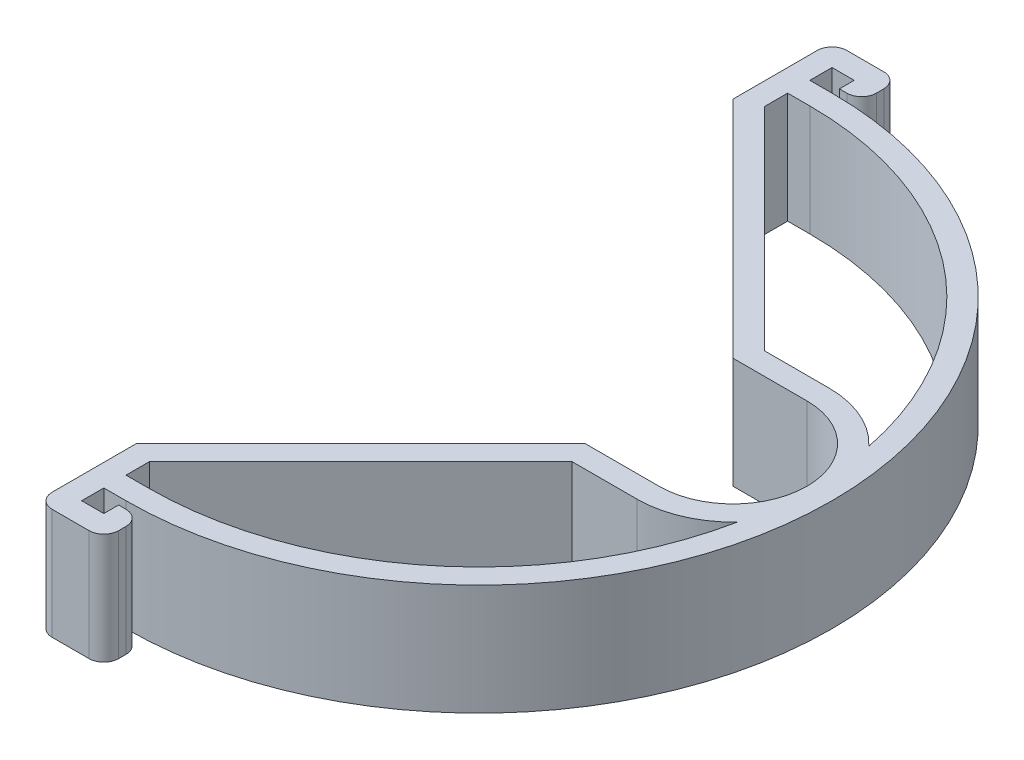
ISO-10303-21;
HEADER;
FILE_DESCRIPTION(('STEP AP214'),'2;1');
FILE_NAME('part.step','',(''),(''),'','','');
FILE_SCHEMA(('AUTOMOTIVE_DESIGN { 1 0 10303 214 1 1 1 1 }'));
ENDSEC;
DATA;
#1=APPLICATION_CONTEXT('core data for automotive mechanical design processes');
#2=APPLICATION_PROTOCOL_DEFINITION('international standard','automotive_design',2000,#1);
#3=PRODUCT_CONTEXT('',#1,'mechanical');
#4=PRODUCT('Part','Part','',(#3));
#5=PRODUCT_RELATED_PRODUCT_CATEGORY('part','',(#4));
#6=PRODUCT_DEFINITION_FORMATION('','',#4);
#7=PRODUCT_DEFINITION_CONTEXT('part definition',#1,'design');
#8=PRODUCT_DEFINITION('design','',#6,#7);
#9=PRODUCT_DEFINITION_SHAPE('','',#8);
#10=(LENGTH_UNIT() NAMED_UNIT(*) SI_UNIT(.MILLI.,.METRE.));
#11=(NAMED_UNIT(*) PLANE_ANGLE_UNIT() SI_UNIT($,.RADIAN.));
#12=(NAMED_UNIT(*) SI_UNIT($,.STERADIAN.) SOLID_ANGLE_UNIT());
#13=UNCERTAINTY_MEASURE_WITH_UNIT(LENGTH_MEASURE(1.E-05),#10,'distance_accuracy_value','');
#14=(GEOMETRIC_REPRESENTATION_CONTEXT(3) GLOBAL_UNCERTAINTY_ASSIGNED_CONTEXT((#13)) GLOBAL_UNIT_ASSIGNED_CONTEXT((#10,
#11,#12)) REPRESENTATION_CONTEXT('',''));
#15=CARTESIAN_POINT('',(0.,0.,0.));
#16=DIRECTION('',(0.,0.,1.));
#17=DIRECTION('',(1.,0.,0.));
#18=AXIS2_PLACEMENT_3D('',#15,#16,#17);
#19=CARTESIAN_POINT('',(0.,15.,13.));
#20=DIRECTION('',(0.,0.,-1.));
#21=DIRECTION('',(-1.,0.,0.));
#22=AXIS2_PLACEMENT_3D('',#19,#20,#21);
#23=PLANE('',#22);
#24=DIRECTION('',(1.,0.,0.));
#25=VECTOR('',#24,1.);
#26=CARTESIAN_POINT('',(0.,0.,13.));
#27=LINE('',#26,#25);
#28=CARTESIAN_POINT('',(25.6032906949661,0.,13.));
#29=VERTEX_POINT('',#28);
#30=CARTESIAN_POINT('',(34.3606500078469,0.,13.));
#31=VERTEX_POINT('',#30);
#32=EDGE_CURVE('E474',#29,#31,#27,.T.);
#33=ORIENTED_EDGE('',*,*,#32,.T.);
#34=DIRECTION('',(0.,-1.,0.));
#35=VECTOR('',#34,1.);
#36=CARTESIAN_POINT('',(34.3606500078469,15.,13.));
#37=LINE('',#36,#35);
#38=CARTESIAN_POINT('',(34.3606500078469,15.,13.));
#39=VERTEX_POINT('',#38);
#40=EDGE_CURVE('E11',#39,#31,#37,.T.);
#41=ORIENTED_EDGE('',*,*,#40,.F.);
#42=DIRECTION('',(1.,0.,0.));
#43=VECTOR('',#42,1.);
#44=CARTESIAN_POINT('',(0.,15.,13.));
#45=LINE('',#44,#43);
#46=CARTESIAN_POINT('',(25.6032906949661,15.,13.));
#47=VERTEX_POINT('',#46);
#48=EDGE_CURVE('E1049',#47,#39,#45,.T.);
#49=ORIENTED_EDGE('',*,*,#48,.F.);
#50=DIRECTION('',(0.,-1.,0.));
#51=VECTOR('',#50,1.);
#52=CARTESIAN_POINT('',(25.6032906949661,15.,13.));
#53=LINE('',#52,#51);
#54=EDGE_CURVE('E61',#47,#29,#53,.T.);
#55=ORIENTED_EDGE('',*,*,#54,.T.);
#56=EDGE_LOOP('',(#33,#41,#49,#55));
#57=FACE_BOUND('',#56,.T.);
#58=ADVANCED_FACE('F41',(#57),#23,.F.);
#59=CARTESIAN_POINT('',(34.3606500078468,15.,0.));
#60=DIRECTION('',(0.,-1.,0.));
#61=DIRECTION('',(0.,0.,-1.));
#62=AXIS2_PLACEMENT_3D('',#59,#60,#61);
#63=CYLINDRICAL_SURFACE('',#62,13.);
#64=CARTESIAN_POINT('',(34.3606500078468,0.,0.));
#65=DIRECTION('',(0.,1.,0.));
#66=DIRECTION('',(0.,0.,1.));
#67=AXIS2_PLACEMENT_3D('',#64,#65,#66);
#68=CIRCLE('',#67,13.);
#69=CARTESIAN_POINT('',(43.8614631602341,0.,8.87324909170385));
#70=VERTEX_POINT('',#69);
#71=EDGE_CURVE('E477',#31,#70,#68,.T.);
#72=ORIENTED_EDGE('',*,*,#71,.T.);
#73=DIRECTION('',(0.,-1.,0.));
#74=VECTOR('',#73,1.);
#75=CARTESIAN_POINT('',(43.8614631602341,15.,8.87324909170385));
#76=LINE('',#75,#74);
#77=CARTESIAN_POINT('',(43.8614631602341,15.,8.87324909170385));
#78=VERTEX_POINT('',#77);
#79=EDGE_CURVE('E52',#78,#70,#76,.T.);
#80=ORIENTED_EDGE('',*,*,#79,.F.);
#81=CARTESIAN_POINT('',(34.3606500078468,15.,0.));
#82=DIRECTION('',(0.,1.,0.));
#83=DIRECTION('',(0.,0.,1.));
#84=AXIS2_PLACEMENT_3D('',#81,#82,#83);
#85=CIRCLE('',#84,13.);
#86=EDGE_CURVE('E1050',#39,#78,#85,.T.);
#87=ORIENTED_EDGE('',*,*,#86,.F.);
#88=ORIENTED_EDGE('',*,*,#40,.T.);
#89=EDGE_LOOP('',(#72,#80,#87,#88));
#90=FACE_BOUND('',#89,.T.);
#91=ADVANCED_FACE('F649',(#90),#63,.T.);
#92=CARTESIAN_POINT('',(0.,15.,0.));
#93=DIRECTION('',(0.,-1.,0.));
#94=DIRECTION('',(0.,0.,-1.));
#95=AXIS2_PLACEMENT_3D('',#92,#93,#94);
#96=CYLINDRICAL_SURFACE('',#95,44.75);
#97=CARTESIAN_POINT('',(0.,0.,0.));
#98=DIRECTION('',(0.,1.,0.));
#99=DIRECTION('',(0.,0.,1.));
#100=AXIS2_PLACEMENT_3D('',#97,#98,#99);
#101=CIRCLE('',#100,44.75);
#102=CARTESIAN_POINT('',(0.,0.,44.75));
#103=VERTEX_POINT('',#102);
#104=EDGE_CURVE('E481',#103,#70,#101,.T.);
#105=ORIENTED_EDGE('',*,*,#104,.F.);
#106=DIRECTION('',(0.,-1.,0.));
#107=VECTOR('',#106,1.);
#108=CARTESIAN_POINT('',(0.,15.,44.75));
#109=LINE('',#108,#107);
#110=CARTESIAN_POINT('',(0.,15.,44.75));
#111=VERTEX_POINT('',#110);
#112=EDGE_CURVE('E328',#111,#103,#109,.T.);
#113=ORIENTED_EDGE('',*,*,#112,.F.);
#114=CARTESIAN_POINT('',(0.,15.,0.));
#115=DIRECTION('',(0.,1.,0.));
#116=DIRECTION('',(0.,0.,1.));
#117=AXIS2_PLACEMENT_3D('',#114,#115,#116);
#118=CIRCLE('',#117,44.75);
#119=EDGE_CURVE('E316',#111,#78,#118,.T.);
#120=ORIENTED_EDGE('',*,*,#119,.T.);
#121=ORIENTED_EDGE('',*,*,#79,.T.);
#122=EDGE_LOOP('',(#105,#113,#120,#121));
#123=FACE_BOUND('',#122,.T.);
#124=ADVANCED_FACE('F654',(#123),#96,.F.);
#125=CARTESIAN_POINT('',(0.,15.,44.75));
#126=DIRECTION('',(0.,0.,1.));
#127=DIRECTION('',(1.,0.,0.));
#128=AXIS2_PLACEMENT_3D('',#125,#126,#127);
#129=PLANE('',#128);
#130=DIRECTION('',(-1.,0.,0.));
#131=VECTOR('',#130,1.);
#132=CARTESIAN_POINT('',(0.,0.,44.75));
#133=LINE('',#132,#131);
#134=CARTESIAN_POINT('',(-2.99999999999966,0.,44.75));
#135=VERTEX_POINT('',#134);
#136=EDGE_CURVE('E324',#103,#135,#133,.T.);
#137=ORIENTED_EDGE('',*,*,#136,.T.);
#138=DIRECTION('',(0.,-1.,0.));
#139=VECTOR('',#138,1.);
#140=CARTESIAN_POINT('',(-2.99999999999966,15.,44.75));
#141=LINE('',#140,#139);
#142=CARTESIAN_POINT('',(-2.99999999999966,15.,44.75));
#143=VERTEX_POINT('',#142);
#144=EDGE_CURVE('E321',#143,#135,#141,.T.);
#145=ORIENTED_EDGE('',*,*,#144,.F.);
#146=DIRECTION('',(-1.,0.,0.));
#147=VECTOR('',#146,1.);
#148=CARTESIAN_POINT('',(0.,15.,44.75));
#149=LINE('',#148,#147);
#150=EDGE_CURVE('E308',#111,#143,#149,.T.);
#151=ORIENTED_EDGE('',*,*,#150,.F.);
#152=ORIENTED_EDGE('',*,*,#112,.T.);
#153=EDGE_LOOP('',(#137,#145,#151,#152));
#154=FACE_BOUND('',#153,.T.);
#155=ADVANCED_FACE('F322',(#154),#129,.F.);
#156=CARTESIAN_POINT('',(-2.99999999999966,15.,0.));
#157=DIRECTION('',(1.,0.,0.));
#158=DIRECTION('',(0.,0.,-1.));
#159=AXIS2_PLACEMENT_3D('',#156,#157,#158);
#160=PLANE('',#159);
#161=DIRECTION('',(0.,0.,1.));
#162=VECTOR('',#161,1.);
#163=CARTESIAN_POINT('',(-2.99999999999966,0.,0.));
#164=LINE('',#163,#162);
#165=CARTESIAN_POINT('',(-2.99999999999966,0.,41.6032906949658));
#166=VERTEX_POINT('',#165);
#167=EDGE_CURVE('E487',#166,#135,#164,.T.);
#168=ORIENTED_EDGE('',*,*,#167,.F.);
#169=DIRECTION('',(0.,-1.,0.));
#170=VECTOR('',#169,1.);
#171=CARTESIAN_POINT('',(-2.99999999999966,15.,41.6032906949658));
#172=LINE('',#171,#170);
#173=CARTESIAN_POINT('',(-2.99999999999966,15.,41.6032906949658));
#174=VERTEX_POINT('',#173);
#175=EDGE_CURVE('E183',#174,#166,#172,.T.);
#176=ORIENTED_EDGE('',*,*,#175,.F.);
#177=DIRECTION('',(0.,0.,1.));
#178=VECTOR('',#177,1.);
#179=CARTESIAN_POINT('',(-2.99999999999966,15.,0.));
#180=LINE('',#179,#178);
#181=EDGE_CURVE('E314',#174,#143,#180,.T.);
#182=ORIENTED_EDGE('',*,*,#181,.T.);
#183=ORIENTED_EDGE('',*,*,#144,.T.);
#184=EDGE_LOOP('',(#168,#176,#182,#183));
#185=FACE_BOUND('',#184,.T.);
#186=ADVANCED_FACE('F330',(#185),#160,.T.);
#187=CARTESIAN_POINT('',(0.99999999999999,15.,50.75));
#188=DIRECTION('',(0.,-1.,0.));
#189=DIRECTION('',(0.,0.,-1.));
#190=AXIS2_PLACEMENT_3D('',#187,#188,#189);
#191=CYLINDRICAL_SURFACE('',#190,2.);
#192=CARTESIAN_POINT('',(0.99999999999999,0.,50.75));
#193=DIRECTION('',(0.,1.,0.));
#194=DIRECTION('',(0.,0.,1.));
#195=AXIS2_PLACEMENT_3D('',#192,#193,#194);
#196=CIRCLE('',#195,2.);
#197=CARTESIAN_POINT('',(0.999999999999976,0.,48.75));
#198=VERTEX_POINT('',#197);
#199=CARTESIAN_POINT('',(2.99999999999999,0.,50.75));
#200=VERTEX_POINT('',#199);
#201=EDGE_CURVE('E362',#198,#200,#196,.F.);
#202=ORIENTED_EDGE('',*,*,#201,.F.);
#203=DIRECTION('',(0.,-1.,0.));
#204=VECTOR('',#203,1.);
#205=CARTESIAN_POINT('',(0.999999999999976,15.,48.75));
#206=LINE('',#205,#204);
#207=CARTESIAN_POINT('',(0.999999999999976,15.,48.75));
#208=VERTEX_POINT('',#207);
#209=EDGE_CURVE('E497',#208,#198,#206,.T.);
#210=ORIENTED_EDGE('',*,*,#209,.F.);
#211=CARTESIAN_POINT('',(0.99999999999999,15.,50.75));
#212=DIRECTION('',(0.,1.,0.));
#213=DIRECTION('',(0.,0.,1.));
#214=AXIS2_PLACEMENT_3D('',#211,#212,#213);
#215=CIRCLE('',#214,2.);
#216=CARTESIAN_POINT('',(2.99999999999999,15.,50.75));
#217=VERTEX_POINT('',#216);
#218=EDGE_CURVE('E1161',#208,#217,#215,.F.);
#219=ORIENTED_EDGE('',*,*,#218,.T.);
#220=DIRECTION('',(0.,-1.,0.));
#221=VECTOR('',#220,1.);
#222=CARTESIAN_POINT('',(2.99999999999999,15.,50.75));
#223=LINE('',#222,#221);
#224=EDGE_CURVE('E504',#217,#200,#223,.T.);
#225=ORIENTED_EDGE('',*,*,#224,.T.);
#226=EDGE_LOOP('',(#202,#210,#219,#225));
#227=FACE_BOUND('',#226,.T.);
#228=ADVANCED_FACE('F766',(#227),#191,.T.);
#229=CARTESIAN_POINT('',(0.,15.,48.75));
#230=DIRECTION('',(0.,0.,-1.));
#231=DIRECTION('',(-1.,0.,0.));
#232=AXIS2_PLACEMENT_3D('',#229,#230,#231);
#233=PLANE('',#232);
#234=DIRECTION('',(1.,0.,0.));
#235=VECTOR('',#234,1.);
#236=CARTESIAN_POINT('',(0.,0.,48.75));
#237=LINE('',#236,#235);
#238=CARTESIAN_POINT('',(0.,0.,48.75));
#239=VERTEX_POINT('',#238);
#240=EDGE_CURVE('E366',#239,#198,#237,.T.);
#241=ORIENTED_EDGE('',*,*,#240,.F.);
#242=DIRECTION('',(0.,-1.,0.));
#243=VECTOR('',#242,1.);
#244=CARTESIAN_POINT('',(0.,15.,48.75));
#245=LINE('',#244,#243);
#246=CARTESIAN_POINT('',(0.,15.,48.75));
#247=VERTEX_POINT('',#246);
#248=EDGE_CURVE('E591',#247,#239,#245,.T.);
#249=ORIENTED_EDGE('',*,*,#248,.F.);
#250=DIRECTION('',(1.,0.,0.));
#251=VECTOR('',#250,1.);
#252=CARTESIAN_POINT('',(0.,15.,48.75));
#253=LINE('',#252,#251);
#254=EDGE_CURVE('E1157',#247,#208,#253,.T.);
#255=ORIENTED_EDGE('',*,*,#254,.T.);
#256=ORIENTED_EDGE('',*,*,#209,.T.);
#257=EDGE_LOOP('',(#241,#249,#255,#256));
#258=FACE_BOUND('',#257,.T.);
#259=ADVANCED_FACE('F762',(#258),#233,.T.);
#260=CARTESIAN_POINT('',(0.,15.,0.));
#261=DIRECTION('',(-1.,0.,0.));
#262=DIRECTION('',(0.,0.,1.));
#263=AXIS2_PLACEMENT_3D('',#260,#261,#262);
#264=PLANE('',#263);
#265=DIRECTION('',(0.,0.,-1.));
#266=VECTOR('',#265,1.);
#267=CARTESIAN_POINT('',(0.,0.,0.));
#268=LINE('',#267,#266);
#269=CARTESIAN_POINT('',(-2.70699938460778E-13,0.,50.75));
#270=VERTEX_POINT('',#269);
#271=EDGE_CURVE('E370',#270,#239,#268,.T.);
#272=ORIENTED_EDGE('',*,*,#271,.F.);
#273=DIRECTION('',(0.,-1.,0.));
#274=VECTOR('',#273,1.);
#275=CARTESIAN_POINT('',(-2.70699938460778E-13,15.,50.75));
#276=LINE('',#275,#274);
#277=CARTESIAN_POINT('',(-2.70699938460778E-13,15.,50.75));
#278=VERTEX_POINT('',#277);
#279=EDGE_CURVE('E588',#278,#270,#276,.T.);
#280=ORIENTED_EDGE('',*,*,#279,.F.);
#281=DIRECTION('',(0.,0.,-1.));
#282=VECTOR('',#281,1.);
#283=CARTESIAN_POINT('',(0.,15.,0.));
#284=LINE('',#283,#282);
#285=EDGE_CURVE('E1153',#278,#247,#284,.T.);
#286=ORIENTED_EDGE('',*,*,#285,.T.);
#287=ORIENTED_EDGE('',*,*,#248,.T.);
#288=EDGE_LOOP('',(#272,#280,#286,#287));
#289=FACE_BOUND('',#288,.T.);
#290=ADVANCED_FACE('F758',(#289),#264,.T.);
#291=CARTESIAN_POINT('',(0.,15.,50.75));
#292=DIRECTION('',(0.,0.,-1.));
#293=DIRECTION('',(-1.,0.,0.));
#294=AXIS2_PLACEMENT_3D('',#291,#292,#293);
#295=PLANE('',#294);
#296=DIRECTION('',(1.,0.,0.));
#297=VECTOR('',#296,1.);
#298=CARTESIAN_POINT('',(0.,0.,50.75));
#299=LINE('',#298,#297);
#300=CARTESIAN_POINT('',(-3.00000000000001,0.,50.75));
#301=VERTEX_POINT('',#300);
#302=EDGE_CURVE('E374',#301,#270,#299,.T.);
#303=ORIENTED_EDGE('',*,*,#302,.F.);
#304=DIRECTION('',(0.,-1.,0.));
#305=VECTOR('',#304,1.);
#306=CARTESIAN_POINT('',(-3.00000000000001,15.,50.75));
#307=LINE('',#306,#305);
#308=CARTESIAN_POINT('',(-3.00000000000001,15.,50.75));
#309=VERTEX_POINT('',#308);
#310=EDGE_CURVE('E585',#309,#301,#307,.T.);
#311=ORIENTED_EDGE('',*,*,#310,.F.);
#312=DIRECTION('',(1.,0.,0.));
#313=VECTOR('',#312,1.);
#314=CARTESIAN_POINT('',(0.,15.,50.75));
#315=LINE('',#314,#313);
#316=EDGE_CURVE('E1149',#309,#278,#315,.T.);
#317=ORIENTED_EDGE('',*,*,#316,.T.);
#318=ORIENTED_EDGE('',*,*,#279,.T.);
#319=EDGE_LOOP('',(#303,#311,#317,#318));
#320=FACE_BOUND('',#319,.T.);
#321=ADVANCED_FACE('F754',(#320),#295,.T.);
#322=CARTESIAN_POINT('',(-3.00000000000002,15.,0.));
#323=DIRECTION('',(-1.,0.,0.));
#324=DIRECTION('',(0.,0.,1.));
#325=AXIS2_PLACEMENT_3D('',#322,#323,#324);
#326=PLANE('',#325);
#327=DIRECTION('',(0.,0.,-1.));
#328=VECTOR('',#327,1.);
#329=CARTESIAN_POINT('',(-3.00000000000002,0.,0.));
#330=LINE('',#329,#328);
#331=CARTESIAN_POINT('',(-3.00000000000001,0.,47.75));
#332=VERTEX_POINT('',#331);
#333=EDGE_CURVE('E378',#301,#332,#330,.T.);
#334=ORIENTED_EDGE('',*,*,#333,.T.);
#335=DIRECTION('',(0.,-1.,0.));
#336=VECTOR('',#335,1.);
#337=CARTESIAN_POINT('',(-3.00000000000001,15.,47.75));
#338=LINE('',#337,#336);
#339=CARTESIAN_POINT('',(-3.00000000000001,15.,47.75));
#340=VERTEX_POINT('',#339);
#341=EDGE_CURVE('E582',#340,#332,#338,.T.);
#342=ORIENTED_EDGE('',*,*,#341,.F.);
#343=DIRECTION('',(0.,0.,-1.));
#344=VECTOR('',#343,1.);
#345=CARTESIAN_POINT('',(-3.00000000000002,15.,0.));
#346=LINE('',#345,#344);
#347=EDGE_CURVE('E1146',#309,#340,#346,.T.);
#348=ORIENTED_EDGE('',*,*,#347,.F.);
#349=ORIENTED_EDGE('',*,*,#310,.T.);
#350=EDGE_LOOP('',(#334,#342,#348,#349));
#351=FACE_BOUND('',#350,.T.);
#352=ADVANCED_FACE('F750',(#351),#326,.F.);
#353=CARTESIAN_POINT('',(0.,15.,47.75));
#354=DIRECTION('',(0.,0.,1.));
#355=DIRECTION('',(1.,0.,0.));
#356=AXIS2_PLACEMENT_3D('',#353,#354,#355);
#357=PLANE('',#356);
#358=DIRECTION('',(-1.,0.,0.));
#359=VECTOR('',#358,1.);
#360=CARTESIAN_POINT('',(0.,0.,47.75));
#361=LINE('',#360,#359);
#362=CARTESIAN_POINT('',(0.,0.,47.75));
#363=VERTEX_POINT('',#362);
#364=EDGE_CURVE('E382',#363,#332,#361,.T.);
#365=ORIENTED_EDGE('',*,*,#364,.F.);
#366=DIRECTION('',(0.,-1.,0.));
#367=VECTOR('',#366,1.);
#368=CARTESIAN_POINT('',(0.,15.,47.75));
#369=LINE('',#368,#367);
#370=CARTESIAN_POINT('',(0.,15.,47.75));
#371=VERTEX_POINT('',#370);
#372=EDGE_CURVE('E579',#371,#363,#369,.T.);
#373=ORIENTED_EDGE('',*,*,#372,.F.);
#374=DIRECTION('',(-1.,0.,0.));
#375=VECTOR('',#374,1.);
#376=CARTESIAN_POINT('',(0.,15.,47.75));
#377=LINE('',#376,#375);
#378=EDGE_CURVE('E1142',#371,#340,#377,.T.);
#379=ORIENTED_EDGE('',*,*,#378,.T.);
#380=ORIENTED_EDGE('',*,*,#341,.T.);
#381=EDGE_LOOP('',(#365,#373,#379,#380));
#382=FACE_BOUND('',#381,.T.);
#383=ADVANCED_FACE('F746',(#382),#357,.T.);
#384=CARTESIAN_POINT('',(0.,15.,0.));
#385=DIRECTION('',(0.,-1.,0.));
#386=DIRECTION('',(0.,0.,-1.));
#387=AXIS2_PLACEMENT_3D('',#384,#385,#386);
#388=CYLINDRICAL_SURFACE('',#387,47.75);
#389=CARTESIAN_POINT('',(0.,0.,0.));
#390=DIRECTION('',(0.,1.,0.));
#391=DIRECTION('',(0.,0.,1.));
#392=AXIS2_PLACEMENT_3D('',#389,#390,#391);
#393=CIRCLE('',#392,47.75);
#394=CARTESIAN_POINT('',(0.,0.,-47.75));
#395=VERTEX_POINT('',#394);
#396=EDGE_CURVE('E386',#363,#395,#393,.T.);
#397=ORIENTED_EDGE('',*,*,#396,.T.);
#398=DIRECTION('',(0.,-1.,0.));
#399=VECTOR('',#398,1.);
#400=CARTESIAN_POINT('',(0.,15.,-47.75));
#401=LINE('',#400,#399);
#402=CARTESIAN_POINT('',(0.,15.,-47.75));
#403=VERTEX_POINT('',#402);
#404=EDGE_CURVE('E575',#403,#395,#401,.T.);
#405=ORIENTED_EDGE('',*,*,#404,.F.);
#406=CARTESIAN_POINT('',(0.,15.,0.));
#407=DIRECTION('',(0.,1.,0.));
#408=DIRECTION('',(0.,0.,1.));
#409=AXIS2_PLACEMENT_3D('',#406,#407,#408);
#410=CIRCLE('',#409,47.75);
#411=EDGE_CURVE('E1138',#371,#403,#410,.T.);
#412=ORIENTED_EDGE('',*,*,#411,.F.);
#413=ORIENTED_EDGE('',*,*,#372,.T.);
#414=EDGE_LOOP('',(#397,#405,#412,#413));
#415=FACE_BOUND('',#414,.T.);
#416=ADVANCED_FACE('F742',(#415),#388,.T.);
#417=CARTESIAN_POINT('',(0.,15.,-47.75));
#418=DIRECTION('',(0.,0.,1.));
#419=DIRECTION('',(1.,0.,0.));
#420=AXIS2_PLACEMENT_3D('',#417,#418,#419);
#421=PLANE('',#420);
#422=DIRECTION('',(-1.,0.,0.));
#423=VECTOR('',#422,1.);
#424=CARTESIAN_POINT('',(0.,0.,-47.75));
#425=LINE('',#424,#423);
#426=CARTESIAN_POINT('',(-3.00000000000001,0.,-47.75));
#427=VERTEX_POINT('',#426);
#428=EDGE_CURVE('E390',#395,#427,#425,.T.);
#429=ORIENTED_EDGE('',*,*,#428,.T.);
#430=DIRECTION('',(0.,-1.,0.));
#431=VECTOR('',#430,1.);
#432=CARTESIAN_POINT('',(-3.00000000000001,15.,-47.75));
#433=LINE('',#432,#431);
#434=CARTESIAN_POINT('',(-3.00000000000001,15.,-47.75));
#435=VERTEX_POINT('',#434);
#436=EDGE_CURVE('E572',#435,#427,#433,.T.);
#437=ORIENTED_EDGE('',*,*,#436,.F.);
#438=DIRECTION('',(-1.,0.,0.));
#439=VECTOR('',#438,1.);
#440=CARTESIAN_POINT('',(0.,15.,-47.75));
#441=LINE('',#440,#439);
#442=EDGE_CURVE('E1135',#403,#435,#441,.T.);
#443=ORIENTED_EDGE('',*,*,#442,.F.);
#444=ORIENTED_EDGE('',*,*,#404,.T.);
#445=EDGE_LOOP('',(#429,#437,#443,#444));
#446=FACE_BOUND('',#445,.T.);
#447=ADVANCED_FACE('F738',(#446),#421,.F.);
#448=CARTESIAN_POINT('',(-3.00000000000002,15.,0.));
#449=DIRECTION('',(1.,0.,0.));
#450=DIRECTION('',(0.,0.,-1.));
#451=AXIS2_PLACEMENT_3D('',#448,#449,#450);
#452=PLANE('',#451);
#453=DIRECTION('',(0.,0.,1.));
#454=VECTOR('',#453,1.);
#455=CARTESIAN_POINT('',(-3.00000000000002,0.,0.));
#456=LINE('',#455,#454);
#457=CARTESIAN_POINT('',(-3.00000000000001,0.,-50.75));
#458=VERTEX_POINT('',#457);
#459=EDGE_CURVE('E394',#458,#427,#456,.T.);
#460=ORIENTED_EDGE('',*,*,#459,.F.);
#461=DIRECTION('',(0.,-1.,0.));
#462=VECTOR('',#461,1.);
#463=CARTESIAN_POINT('',(-3.00000000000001,15.,-50.75));
#464=LINE('',#463,#462);
#465=CARTESIAN_POINT('',(-3.00000000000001,15.,-50.75));
#466=VERTEX_POINT('',#465);
#467=EDGE_CURVE('E569',#466,#458,#464,.T.);
#468=ORIENTED_EDGE('',*,*,#467,.F.);
#469=DIRECTION('',(0.,0.,1.));
#470=VECTOR('',#469,1.);
#471=CARTESIAN_POINT('',(-3.00000000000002,15.,0.));
#472=LINE('',#471,#470);
#473=EDGE_CURVE('E1131',#466,#435,#472,.T.);
#474=ORIENTED_EDGE('',*,*,#473,.T.);
#475=ORIENTED_EDGE('',*,*,#436,.T.);
#476=EDGE_LOOP('',(#460,#468,#474,#475));
#477=FACE_BOUND('',#476,.T.);
#478=ADVANCED_FACE('F734',(#477),#452,.T.);
#479=CARTESIAN_POINT('',(0.,15.,-50.75));
#480=DIRECTION('',(0.,0.,-1.));
#481=DIRECTION('',(-1.,0.,0.));
#482=AXIS2_PLACEMENT_3D('',#479,#480,#481);
#483=PLANE('',#482);
#484=DIRECTION('',(1.,0.,0.));
#485=VECTOR('',#484,1.);
#486=CARTESIAN_POINT('',(0.,0.,-50.75));
#487=LINE('',#486,#485);
#488=CARTESIAN_POINT('',(0.,0.,-50.75));
#489=VERTEX_POINT('',#488);
#490=EDGE_CURVE('E398',#458,#489,#487,.T.);
#491=ORIENTED_EDGE('',*,*,#490,.T.);
#492=DIRECTION('',(0.,-1.,0.));
#493=VECTOR('',#492,1.);
#494=CARTESIAN_POINT('',(0.,15.,-50.75));
#495=LINE('',#494,#493);
#496=CARTESIAN_POINT('',(0.,15.,-50.75));
#497=VERTEX_POINT('',#496);
#498=EDGE_CURVE('E565',#497,#489,#495,.T.);
#499=ORIENTED_EDGE('',*,*,#498,.F.);
#500=DIRECTION('',(1.,0.,0.));
#501=VECTOR('',#500,1.);
#502=CARTESIAN_POINT('',(0.,15.,-50.75));
#503=LINE('',#502,#501);
#504=EDGE_CURVE('E1127',#466,#497,#503,.T.);
#505=ORIENTED_EDGE('',*,*,#504,.F.);
#506=ORIENTED_EDGE('',*,*,#467,.T.);
#507=EDGE_LOOP('',(#491,#499,#505,#506));
#508=FACE_BOUND('',#507,.T.);
#509=ADVANCED_FACE('F730',(#508),#483,.F.);
#510=CARTESIAN_POINT('',(0.,15.,0.));
#511=DIRECTION('',(1.,0.,0.));
#512=DIRECTION('',(0.,0.,-1.));
#513=AXIS2_PLACEMENT_3D('',#510,#511,#512);
#514=PLANE('',#513);
#515=DIRECTION('',(0.,0.,1.));
#516=VECTOR('',#515,1.);
#517=CARTESIAN_POINT('',(0.,0.,0.));
#518=LINE('',#517,#516);
#519=CARTESIAN_POINT('',(-2.60031960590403E-13,0.,-48.75));
#520=VERTEX_POINT('',#519);
#521=EDGE_CURVE('E402',#489,#520,#518,.T.);
#522=ORIENTED_EDGE('',*,*,#521,.T.);
#523=DIRECTION('',(0.,-1.,0.));
#524=VECTOR('',#523,1.);
#525=CARTESIAN_POINT('',(-2.60031960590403E-13,15.,-48.75));
#526=LINE('',#525,#524);
#527=CARTESIAN_POINT('',(-2.60031960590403E-13,15.,-48.75));
#528=VERTEX_POINT('',#527);
#529=EDGE_CURVE('E561',#528,#520,#526,.T.);
#530=ORIENTED_EDGE('',*,*,#529,.F.);
#531=DIRECTION('',(0.,0.,1.));
#532=VECTOR('',#531,1.);
#533=CARTESIAN_POINT('',(0.,15.,0.));
#534=LINE('',#533,#532);
#535=EDGE_CURVE('E1123',#497,#528,#534,.T.);
#536=ORIENTED_EDGE('',*,*,#535,.F.);
#537=ORIENTED_EDGE('',*,*,#498,.T.);
#538=EDGE_LOOP('',(#522,#530,#536,#537));
#539=FACE_BOUND('',#538,.T.);
#540=ADVANCED_FACE('F726',(#539),#514,.F.);
#541=CARTESIAN_POINT('',(0.,15.,-48.75));
#542=DIRECTION('',(0.,0.,-1.));
#543=DIRECTION('',(-1.,0.,0.));
#544=AXIS2_PLACEMENT_3D('',#541,#542,#543);
#545=PLANE('',#544);
#546=DIRECTION('',(1.,0.,0.));
#547=VECTOR('',#546,1.);
#548=CARTESIAN_POINT('',(0.,0.,-48.75));
#549=LINE('',#548,#547);
#550=CARTESIAN_POINT('',(0.999999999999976,0.,-48.75));
#551=VERTEX_POINT('',#550);
#552=EDGE_CURVE('E406',#520,#551,#549,.T.);
#553=ORIENTED_EDGE('',*,*,#552,.T.);
#554=DIRECTION('',(0.,-1.,0.));
#555=VECTOR('',#554,1.);
#556=CARTESIAN_POINT('',(0.999999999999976,15.,-48.75));
#557=LINE('',#556,#555);
#558=CARTESIAN_POINT('',(0.999999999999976,15.,-48.75));
#559=VERTEX_POINT('',#558);
#560=EDGE_CURVE('E557',#559,#551,#557,.T.);
#561=ORIENTED_EDGE('',*,*,#560,.F.);
#562=DIRECTION('',(1.,0.,0.));
#563=VECTOR('',#562,1.);
#564=CARTESIAN_POINT('',(0.,15.,-48.75));
#565=LINE('',#564,#563);
#566=EDGE_CURVE('E1119',#528,#559,#565,.T.);
#567=ORIENTED_EDGE('',*,*,#566,.F.);
#568=ORIENTED_EDGE('',*,*,#529,.T.);
#569=EDGE_LOOP('',(#553,#561,#567,#568));
#570=FACE_BOUND('',#569,.T.);
#571=ADVANCED_FACE('F722',(#570),#545,.F.);
#572=CARTESIAN_POINT('',(0.99999999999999,15.,-50.75));
#573=DIRECTION('',(0.,-1.,0.));
#574=DIRECTION('',(0.,0.,-1.));
#575=AXIS2_PLACEMENT_3D('',#572,#573,#574);
#576=CYLINDRICAL_SURFACE('',#575,2.);
#577=CARTESIAN_POINT('',(0.99999999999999,0.,-50.75));
#578=DIRECTION('',(0.,1.,0.));
#579=DIRECTION('',(0.,0.,1.));
#580=AXIS2_PLACEMENT_3D('',#577,#578,#579);
#581=CIRCLE('',#580,2.);
#582=CARTESIAN_POINT('',(2.99999999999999,0.,-50.75));
#583=VERTEX_POINT('',#582);
#584=EDGE_CURVE('E410',#551,#583,#581,.T.);
#585=ORIENTED_EDGE('',*,*,#584,.T.);
#586=DIRECTION('',(0.,-1.,0.));
#587=VECTOR('',#586,1.);
#588=CARTESIAN_POINT('',(2.99999999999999,15.,-50.75));
#589=LINE('',#588,#587);
#590=CARTESIAN_POINT('',(2.99999999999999,15.,-50.75));
#591=VERTEX_POINT('',#590);
#592=EDGE_CURVE('E554',#591,#583,#589,.T.);
#593=ORIENTED_EDGE('',*,*,#592,.F.);
#594=CARTESIAN_POINT('',(0.99999999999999,15.,-50.75));
#595=DIRECTION('',(0.,1.,0.));
#596=DIRECTION('',(0.,0.,1.));
#597=AXIS2_PLACEMENT_3D('',#594,#595,#596);
#598=CIRCLE('',#597,2.);
#599=EDGE_CURVE('E1116',#559,#591,#598,.T.);
#600=ORIENTED_EDGE('',*,*,#599,.F.);
#601=ORIENTED_EDGE('',*,*,#560,.T.);
#602=EDGE_LOOP('',(#585,#593,#600,#601));
#603=FACE_BOUND('',#602,.T.);
#604=ADVANCED_FACE('F718',(#603),#576,.T.);
#605=CARTESIAN_POINT('',(2.99999999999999,15.,0.));
#606=DIRECTION('',(1.,0.,0.));
#607=DIRECTION('',(0.,0.,-1.));
#608=AXIS2_PLACEMENT_3D('',#605,#606,#607);
#609=PLANE('',#608);
#610=DIRECTION('',(0.,0.,1.));
#611=VECTOR('',#610,1.);
#612=CARTESIAN_POINT('',(2.99999999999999,0.,0.));
#613=LINE('',#612,#611);
#614=CARTESIAN_POINT('',(2.99999999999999,0.,-51.75));
#615=VERTEX_POINT('',#614);
#616=EDGE_CURVE('E414',#615,#583,#613,.T.);
#617=ORIENTED_EDGE('',*,*,#616,.F.);
#618=DIRECTION('',(0.,-1.,0.));
#619=VECTOR('',#618,1.);
#620=CARTESIAN_POINT('',(2.99999999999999,15.,-51.75));
#621=LINE('',#620,#619);
#622=CARTESIAN_POINT('',(2.99999999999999,15.,-51.75));
#623=VERTEX_POINT('',#622);
#624=EDGE_CURVE('E551',#623,#615,#621,.T.);
#625=ORIENTED_EDGE('',*,*,#624,.F.);
#626=DIRECTION('',(0.,0.,1.));
#627=VECTOR('',#626,1.);
#628=CARTESIAN_POINT('',(2.99999999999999,15.,0.));
#629=LINE('',#628,#627);
#630=EDGE_CURVE('E1112',#623,#591,#629,.T.);
#631=ORIENTED_EDGE('',*,*,#630,.T.);
#632=ORIENTED_EDGE('',*,*,#592,.T.);
#633=EDGE_LOOP('',(#617,#625,#631,#632));
#634=FACE_BOUND('',#633,.T.);
#635=ADVANCED_FACE('F714',(#634),#609,.T.);
#636=CARTESIAN_POINT('',(0.99999999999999,15.,-51.75));
#637=DIRECTION('',(0.,-1.,0.));
#638=DIRECTION('',(0.,0.,-1.));
#639=AXIS2_PLACEMENT_3D('',#636,#637,#638);
#640=CYLINDRICAL_SURFACE('',#639,2.);
#641=CARTESIAN_POINT('',(0.99999999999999,0.,-51.75));
#642=DIRECTION('',(0.,1.,0.));
#643=DIRECTION('',(0.,0.,1.));
#644=AXIS2_PLACEMENT_3D('',#641,#642,#643);
#645=CIRCLE('',#644,2.);
#646=CARTESIAN_POINT('',(0.999999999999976,0.,-53.75));
#647=VERTEX_POINT('',#646);
#648=EDGE_CURVE('E418',#647,#615,#645,.F.);
#649=ORIENTED_EDGE('',*,*,#648,.F.);
#650=DIRECTION('',(0.,-1.,0.));
#651=VECTOR('',#650,1.);
#652=CARTESIAN_POINT('',(0.999999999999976,15.,-53.75));
#653=LINE('',#652,#651);
#654=CARTESIAN_POINT('',(0.999999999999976,15.,-53.75));
#655=VERTEX_POINT('',#654);
#656=EDGE_CURVE('E548',#655,#647,#653,.T.);
#657=ORIENTED_EDGE('',*,*,#656,.F.);
#658=CARTESIAN_POINT('',(0.99999999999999,15.,-51.75));
#659=DIRECTION('',(0.,1.,0.));
#660=DIRECTION('',(0.,0.,1.));
#661=AXIS2_PLACEMENT_3D('',#658,#659,#660);
#662=CIRCLE('',#661,2.);
#663=EDGE_CURVE('E1108',#655,#623,#662,.F.);
#664=ORIENTED_EDGE('',*,*,#663,.T.);
#665=ORIENTED_EDGE('',*,*,#624,.T.);
#666=EDGE_LOOP('',(#649,#657,#664,#665));
#667=FACE_BOUND('',#666,.T.);
#668=ADVANCED_FACE('F710',(#667),#640,.T.);
#669=CARTESIAN_POINT('',(0.,15.,-53.75));
#670=DIRECTION('',(0.,0.,-1.));
#671=DIRECTION('',(-1.,0.,0.));
#672=AXIS2_PLACEMENT_3D('',#669,#670,#671);
#673=PLANE('',#672);
#674=DIRECTION('',(1.,0.,0.));
#675=VECTOR('',#674,1.);
#676=CARTESIAN_POINT('',(0.,0.,-53.75));
#677=LINE('',#676,#675);
#678=CARTESIAN_POINT('',(-3.99999999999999,0.,-53.75));
#679=VERTEX_POINT('',#678);
#680=EDGE_CURVE('E422',#679,#647,#677,.T.);
#681=ORIENTED_EDGE('',*,*,#680,.F.);
#682=DIRECTION('',(0.,-1.,0.));
#683=VECTOR('',#682,1.);
#684=CARTESIAN_POINT('',(-3.99999999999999,15.,-53.75));
#685=LINE('',#684,#683);
#686=CARTESIAN_POINT('',(-3.99999999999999,15.,-53.75));
#687=VERTEX_POINT('',#686);
#688=EDGE_CURVE('E545',#687,#679,#685,.T.);
#689=ORIENTED_EDGE('',*,*,#688,.F.);
#690=DIRECTION('',(1.,0.,0.));
#691=VECTOR('',#690,1.);
#692=CARTESIAN_POINT('',(0.,15.,-53.75));
#693=LINE('',#692,#691);
#694=EDGE_CURVE('E1104',#687,#655,#693,.T.);
#695=ORIENTED_EDGE('',*,*,#694,.T.);
#696=ORIENTED_EDGE('',*,*,#656,.T.);
#697=EDGE_LOOP('',(#681,#689,#695,#696));
#698=FACE_BOUND('',#697,.T.);
#699=ADVANCED_FACE('F706',(#698),#673,.T.);
#700=CARTESIAN_POINT('',(-4.00000000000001,15.,-51.75));
#701=DIRECTION('',(0.,-1.,0.));
#702=DIRECTION('',(0.,0.,-1.));
#703=AXIS2_PLACEMENT_3D('',#700,#701,#702);
#704=CYLINDRICAL_SURFACE('',#703,2.);
#705=CARTESIAN_POINT('',(-4.00000000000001,0.,-51.75));
#706=DIRECTION('',(0.,1.,0.));
#707=DIRECTION('',(0.,0.,1.));
#708=AXIS2_PLACEMENT_3D('',#705,#706,#707);
#709=CIRCLE('',#708,2.);
#710=CARTESIAN_POINT('',(-6.00000000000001,0.,-51.75));
#711=VERTEX_POINT('',#710);
#712=EDGE_CURVE('E426',#711,#679,#709,.F.);
#713=ORIENTED_EDGE('',*,*,#712,.F.);
#714=DIRECTION('',(0.,-1.,0.));
#715=VECTOR('',#714,1.);
#716=CARTESIAN_POINT('',(-6.00000000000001,15.,-51.75));
#717=LINE('',#716,#715);
#718=CARTESIAN_POINT('',(-6.00000000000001,15.,-51.75));
#719=VERTEX_POINT('',#718);
#720=EDGE_CURVE('E542',#719,#711,#717,.T.);
#721=ORIENTED_EDGE('',*,*,#720,.F.);
#722=CARTESIAN_POINT('',(-4.00000000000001,15.,-51.75));
#723=DIRECTION('',(0.,1.,0.));
#724=DIRECTION('',(0.,0.,1.));
#725=AXIS2_PLACEMENT_3D('',#722,#723,#724);
#726=CIRCLE('',#725,2.);
#727=EDGE_CURVE('E1100',#719,#687,#726,.F.);
#728=ORIENTED_EDGE('',*,*,#727,.T.);
#729=ORIENTED_EDGE('',*,*,#688,.T.);
#730=EDGE_LOOP('',(#713,#721,#728,#729));
#731=FACE_BOUND('',#730,.T.);
#732=ADVANCED_FACE('F702',(#731),#704,.T.);
#733=CARTESIAN_POINT('',(-6.00000000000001,15.,0.));
#734=DIRECTION('',(-1.,0.,0.));
#735=DIRECTION('',(0.,0.,1.));
#736=AXIS2_PLACEMENT_3D('',#733,#734,#735);
#737=PLANE('',#736);
#738=DIRECTION('',(0.,0.,-1.));
#739=VECTOR('',#738,1.);
#740=CARTESIAN_POINT('',(-6.00000000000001,0.,0.));
#741=LINE('',#740,#739);
#742=CARTESIAN_POINT('',(-6.00000000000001,0.,-40.3606500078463));
#743=VERTEX_POINT('',#742);
#744=EDGE_CURVE('E430',#743,#711,#741,.T.);
#745=ORIENTED_EDGE('',*,*,#744,.F.);
#746=DIRECTION('',(0.,-1.,0.));
#747=VECTOR('',#746,1.);
#748=CARTESIAN_POINT('',(-6.00000000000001,15.,-40.3606500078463));
#749=LINE('',#748,#747);
#750=CARTESIAN_POINT('',(-6.00000000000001,15.,-40.3606500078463));
#751=VERTEX_POINT('',#750);
#752=EDGE_CURVE('E539',#751,#743,#749,.T.);
#753=ORIENTED_EDGE('',*,*,#752,.F.);
#754=DIRECTION('',(0.,0.,-1.));
#755=VECTOR('',#754,1.);
#756=CARTESIAN_POINT('',(-6.00000000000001,15.,0.));
#757=LINE('',#756,#755);
#758=EDGE_CURVE('E1096',#751,#719,#757,.T.);
#759=ORIENTED_EDGE('',*,*,#758,.T.);
#760=ORIENTED_EDGE('',*,*,#720,.T.);
#761=EDGE_LOOP('',(#745,#753,#759,#760));
#762=FACE_BOUND('',#761,.T.);
#763=ADVANCED_FACE('F698',(#762),#737,.T.);
#764=CARTESIAN_POINT('',(17.1803250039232,15.,-17.1803250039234));
#765=DIRECTION('',(-0.707106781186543,0.,0.707106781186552));
#766=DIRECTION('',(0.707106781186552,0.,0.707106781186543));
#767=AXIS2_PLACEMENT_3D('',#764,#765,#766);
#768=PLANE('',#767);
#769=DIRECTION('',(-0.707106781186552,0.,-0.707106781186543));
#770=VECTOR('',#769,1.);
#771=CARTESIAN_POINT('',(17.1803250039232,0.,-17.1803250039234));
#772=LINE('',#771,#770);
#773=CARTESIAN_POINT('',(24.3606500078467,0.,-10.));
#774=VERTEX_POINT('',#773);
#775=EDGE_CURVE('E434',#774,#743,#772,.T.);
#776=ORIENTED_EDGE('',*,*,#775,.F.);
#777=DIRECTION('',(0.,-1.,0.));
#778=VECTOR('',#777,1.);
#779=CARTESIAN_POINT('',(24.3606500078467,15.,-10.));
#780=LINE('',#779,#778);
#781=CARTESIAN_POINT('',(24.3606500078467,15.,-10.));
#782=VERTEX_POINT('',#781);
#783=EDGE_CURVE('E536',#782,#774,#780,.T.);
#784=ORIENTED_EDGE('',*,*,#783,.F.);
#785=DIRECTION('',(-0.707106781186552,0.,-0.707106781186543));
#786=VECTOR('',#785,1.);
#787=CARTESIAN_POINT('',(17.1803250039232,15.,-17.1803250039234));
#788=LINE('',#787,#786);
#789=EDGE_CURVE('E1092',#782,#751,#788,.T.);
#790=ORIENTED_EDGE('',*,*,#789,.T.);
#791=ORIENTED_EDGE('',*,*,#752,.T.);
#792=EDGE_LOOP('',(#776,#784,#790,#791));
#793=FACE_BOUND('',#792,.T.);
#794=ADVANCED_FACE('F694',(#793),#768,.T.);
#795=CARTESIAN_POINT('',(0.,15.,-10.));
#796=DIRECTION('',(0.,0.,1.));
#797=DIRECTION('',(1.,0.,0.));
#798=AXIS2_PLACEMENT_3D('',#795,#796,#797);
#799=PLANE('',#798);
#800=DIRECTION('',(-1.,0.,0.));
#801=VECTOR('',#800,1.);
#802=CARTESIAN_POINT('',(0.,0.,-10.));
#803=LINE('',#802,#801);
#804=CARTESIAN_POINT('',(34.3606500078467,0.,-10.));
#805=VERTEX_POINT('',#804);
#806=EDGE_CURVE('E438',#805,#774,#803,.T.);
#807=ORIENTED_EDGE('',*,*,#806,.F.);
#808=DIRECTION('',(0.,-1.,0.));
#809=VECTOR('',#808,1.);
#810=CARTESIAN_POINT('',(34.3606500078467,15.,-10.));
#811=LINE('',#810,#809);
#812=CARTESIAN_POINT('',(34.3606500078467,15.,-10.));
#813=VERTEX_POINT('',#812);
#814=EDGE_CURVE('E533',#813,#805,#811,.T.);
#815=ORIENTED_EDGE('',*,*,#814,.F.);
#816=DIRECTION('',(-1.,0.,0.));
#817=VECTOR('',#816,1.);
#818=CARTESIAN_POINT('',(0.,15.,-10.));
#819=LINE('',#818,#817);
#820=EDGE_CURVE('E1088',#813,#782,#819,.T.);
#821=ORIENTED_EDGE('',*,*,#820,.T.);
#822=ORIENTED_EDGE('',*,*,#783,.T.);
#823=EDGE_LOOP('',(#807,#815,#821,#822));
#824=FACE_BOUND('',#823,.T.);
#825=ADVANCED_FACE('F690',(#824),#799,.T.);
#826=CARTESIAN_POINT('',(34.3606500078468,15.,0.));
#827=DIRECTION('',(0.,-1.,0.));
#828=DIRECTION('',(0.,0.,-1.));
#829=AXIS2_PLACEMENT_3D('',#826,#827,#828);
#830=CYLINDRICAL_SURFACE('',#829,10.);
#831=CARTESIAN_POINT('',(34.3606500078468,0.,0.));
#832=DIRECTION('',(0.,1.,0.));
#833=DIRECTION('',(0.,0.,1.));
#834=AXIS2_PLACEMENT_3D('',#831,#832,#833);
#835=CIRCLE('',#834,10.);
#836=CARTESIAN_POINT('',(34.3606500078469,0.,10.));
#837=VERTEX_POINT('',#836);
#838=EDGE_CURVE('E442',#837,#805,#835,.T.);
#839=ORIENTED_EDGE('',*,*,#838,.F.);
#840=DIRECTION('',(0.,-1.,0.));
#841=VECTOR('',#840,1.);
#842=CARTESIAN_POINT('',(34.3606500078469,15.,10.));
#843=LINE('',#842,#841);
#844=CARTESIAN_POINT('',(34.3606500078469,15.,10.));
#845=VERTEX_POINT('',#844);
#846=EDGE_CURVE('E530',#845,#837,#843,.T.);
#847=ORIENTED_EDGE('',*,*,#846,.F.);
#848=CARTESIAN_POINT('',(34.3606500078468,15.,0.));
#849=DIRECTION('',(0.,1.,0.));
#850=DIRECTION('',(0.,0.,1.));
#851=AXIS2_PLACEMENT_3D('',#848,#849,#850);
#852=CIRCLE('',#851,10.);
#853=EDGE_CURVE('E1084',#845,#813,#852,.T.);
#854=ORIENTED_EDGE('',*,*,#853,.T.);
#855=ORIENTED_EDGE('',*,*,#814,.T.);
#856=EDGE_LOOP('',(#839,#847,#854,#855));
#857=FACE_BOUND('',#856,.T.);
#858=ADVANCED_FACE('F686',(#857),#830,.F.);
#859=CARTESIAN_POINT('',(0.,15.,10.));
#860=DIRECTION('',(0.,0.,-1.));
#861=DIRECTION('',(-1.,0.,0.));
#862=AXIS2_PLACEMENT_3D('',#859,#860,#861);
#863=PLANE('',#862);
#864=DIRECTION('',(1.,0.,0.));
#865=VECTOR('',#864,1.);
#866=CARTESIAN_POINT('',(0.,0.,10.));
#867=LINE('',#866,#865);
#868=CARTESIAN_POINT('',(24.3606500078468,0.,10.));
#869=VERTEX_POINT('',#868);
#870=EDGE_CURVE('E446',#869,#837,#867,.T.);
#871=ORIENTED_EDGE('',*,*,#870,.F.);
#872=DIRECTION('',(0.,-1.,0.));
#873=VECTOR('',#872,1.);
#874=CARTESIAN_POINT('',(24.3606500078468,15.,10.));
#875=LINE('',#874,#873);
#876=CARTESIAN_POINT('',(24.3606500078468,15.,10.));
#877=VERTEX_POINT('',#876);
#878=EDGE_CURVE('E527',#877,#869,#875,.T.);
#879=ORIENTED_EDGE('',*,*,#878,.F.);
#880=DIRECTION('',(1.,0.,0.));
#881=VECTOR('',#880,1.);
#882=CARTESIAN_POINT('',(0.,15.,10.));
#883=LINE('',#882,#881);
#884=EDGE_CURVE('E1080',#877,#845,#883,.T.);
#885=ORIENTED_EDGE('',*,*,#884,.T.);
#886=ORIENTED_EDGE('',*,*,#846,.T.);
#887=EDGE_LOOP('',(#871,#879,#885,#886));
#888=FACE_BOUND('',#887,.T.);
#889=ADVANCED_FACE('F682',(#888),#863,.T.);
#890=CARTESIAN_POINT('',(17.1803250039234,15.,17.1803250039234));
#891=DIRECTION('',(0.707106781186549,0.,0.707106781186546));
#892=DIRECTION('',(0.707106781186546,0.,-0.707106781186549));
#893=AXIS2_PLACEMENT_3D('',#890,#891,#892);
#894=PLANE('',#893);
#895=DIRECTION('',(-0.707106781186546,0.,0.707106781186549));
#896=VECTOR('',#895,1.);
#897=CARTESIAN_POINT('',(17.1803250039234,0.,17.1803250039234));
#898=LINE('',#897,#896);
#899=CARTESIAN_POINT('',(-5.99999999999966,0.,40.3606500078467));
#900=VERTEX_POINT('',#899);
#901=EDGE_CURVE('E450',#869,#900,#898,.T.);
#902=ORIENTED_EDGE('',*,*,#901,.T.);
#903=DIRECTION('',(0.,-1.,0.));
#904=VECTOR('',#903,1.);
#905=CARTESIAN_POINT('',(-5.99999999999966,15.,40.3606500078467));
#906=LINE('',#905,#904);
#907=CARTESIAN_POINT('',(-5.99999999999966,15.,40.3606500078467));
#908=VERTEX_POINT('',#907);
#909=EDGE_CURVE('E523',#908,#900,#906,.T.);
#910=ORIENTED_EDGE('',*,*,#909,.F.);
#911=DIRECTION('',(-0.707106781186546,0.,0.707106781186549));
#912=VECTOR('',#911,1.);
#913=CARTESIAN_POINT('',(17.1803250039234,15.,17.1803250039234));
#914=LINE('',#913,#912);
#915=EDGE_CURVE('E1076',#877,#908,#914,.T.);
#916=ORIENTED_EDGE('',*,*,#915,.F.);
#917=ORIENTED_EDGE('',*,*,#878,.T.);
#918=EDGE_LOOP('',(#902,#910,#916,#917));
#919=FACE_BOUND('',#918,.T.);
#920=ADVANCED_FACE('F678',(#919),#894,.F.);
#921=CARTESIAN_POINT('',(-5.99999999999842,15.,-1.84600952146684E-13));
#922=DIRECTION('',(1.,0.,0.));
#923=DIRECTION('',(0.,0.,-1.));
#924=AXIS2_PLACEMENT_3D('',#921,#922,#923);
#925=PLANE('',#924);
#926=DIRECTION('',(0.,0.,1.));
#927=VECTOR('',#926,1.);
#928=CARTESIAN_POINT('',(-5.99999999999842,0.,-1.84600952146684E-13));
#929=LINE('',#928,#927);
#930=CARTESIAN_POINT('',(-6.00000000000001,0.,51.75));
#931=VERTEX_POINT('',#930);
#932=EDGE_CURVE('E454',#900,#931,#929,.T.);
#933=ORIENTED_EDGE('',*,*,#932,.T.);
#934=DIRECTION('',(0.,-1.,0.));
#935=VECTOR('',#934,1.);
#936=CARTESIAN_POINT('',(-6.00000000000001,15.,51.75));
#937=LINE('',#936,#935);
#938=CARTESIAN_POINT('',(-6.00000000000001,15.,51.75));
#939=VERTEX_POINT('',#938);
#940=EDGE_CURVE('E519',#939,#931,#937,.T.);
#941=ORIENTED_EDGE('',*,*,#940,.F.);
#942=DIRECTION('',(0.,0.,1.));
#943=VECTOR('',#942,1.);
#944=CARTESIAN_POINT('',(-5.99999999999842,15.,-1.84600952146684E-13));
#945=LINE('',#944,#943);
#946=EDGE_CURVE('E1072',#908,#939,#945,.T.);
#947=ORIENTED_EDGE('',*,*,#946,.F.);
#948=ORIENTED_EDGE('',*,*,#909,.T.);
#949=EDGE_LOOP('',(#933,#941,#947,#948));
#950=FACE_BOUND('',#949,.T.);
#951=ADVANCED_FACE('F674',(#950),#925,.F.);
#952=CARTESIAN_POINT('',(-4.00000000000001,15.,51.75));
#953=DIRECTION('',(0.,-1.,0.));
#954=DIRECTION('',(0.,0.,-1.));
#955=AXIS2_PLACEMENT_3D('',#952,#953,#954);
#956=CYLINDRICAL_SURFACE('',#955,2.);
#957=CARTESIAN_POINT('',(-4.00000000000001,0.,51.75));
#958=DIRECTION('',(0.,1.,0.));
#959=DIRECTION('',(0.,0.,1.));
#960=AXIS2_PLACEMENT_3D('',#957,#958,#959);
#961=CIRCLE('',#960,2.);
#962=CARTESIAN_POINT('',(-3.99999999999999,0.,53.75));
#963=VERTEX_POINT('',#962);
#964=EDGE_CURVE('E458',#931,#963,#961,.T.);
#965=ORIENTED_EDGE('',*,*,#964,.T.);
#966=DIRECTION('',(0.,-1.,0.));
#967=VECTOR('',#966,1.);
#968=CARTESIAN_POINT('',(-3.99999999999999,15.,53.75));
#969=LINE('',#968,#967);
#970=CARTESIAN_POINT('',(-3.99999999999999,15.,53.75));
#971=VERTEX_POINT('',#970);
#972=EDGE_CURVE('E515',#971,#963,#969,.T.);
#973=ORIENTED_EDGE('',*,*,#972,.F.);
#974=CARTESIAN_POINT('',(-4.00000000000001,15.,51.75));
#975=DIRECTION('',(0.,1.,0.));
#976=DIRECTION('',(0.,0.,1.));
#977=AXIS2_PLACEMENT_3D('',#974,#975,#976);
#978=CIRCLE('',#977,2.);
#979=EDGE_CURVE('E1068',#939,#971,#978,.T.);
#980=ORIENTED_EDGE('',*,*,#979,.F.);
#981=ORIENTED_EDGE('',*,*,#940,.T.);
#982=EDGE_LOOP('',(#965,#973,#980,#981));
#983=FACE_BOUND('',#982,.T.);
#984=ADVANCED_FACE('F670',(#983),#956,.T.);
#985=CARTESIAN_POINT('',(0.,15.,53.75));
#986=DIRECTION('',(0.,0.,-1.));
#987=DIRECTION('',(-1.,0.,0.));
#988=AXIS2_PLACEMENT_3D('',#985,#986,#987);
#989=PLANE('',#988);
#990=DIRECTION('',(1.,0.,0.));
#991=VECTOR('',#990,1.);
#992=CARTESIAN_POINT('',(0.,0.,53.75));
#993=LINE('',#992,#991);
#994=CARTESIAN_POINT('',(0.999999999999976,0.,53.75));
#995=VERTEX_POINT('',#994);
#996=EDGE_CURVE('E462',#963,#995,#993,.T.);
#997=ORIENTED_EDGE('',*,*,#996,.T.);
#998=DIRECTION('',(0.,-1.,0.));
#999=VECTOR('',#998,1.);
#1000=CARTESIAN_POINT('',(0.999999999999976,15.,53.75));
#1001=LINE('',#1000,#999);
#1002=CARTESIAN_POINT('',(0.999999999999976,15.,53.75));
#1003=VERTEX_POINT('',#1002);
#1004=EDGE_CURVE('E511',#1003,#995,#1001,.T.);
#1005=ORIENTED_EDGE('',*,*,#1004,.F.);
#1006=DIRECTION('',(1.,0.,0.));
#1007=VECTOR('',#1006,1.);
#1008=CARTESIAN_POINT('',(0.,15.,53.75));
#1009=LINE('',#1008,#1007);
#1010=EDGE_CURVE('E1064',#971,#1003,#1009,.T.);
#1011=ORIENTED_EDGE('',*,*,#1010,.F.);
#1012=ORIENTED_EDGE('',*,*,#972,.T.);
#1013=EDGE_LOOP('',(#997,#1005,#1011,#1012));
#1014=FACE_BOUND('',#1013,.T.);
#1015=ADVANCED_FACE('F666',(#1014),#989,.F.);
#1016=CARTESIAN_POINT('',(0.99999999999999,15.,51.75));
#1017=DIRECTION('',(0.,-1.,0.));
#1018=DIRECTION('',(0.,0.,-1.));
#1019=AXIS2_PLACEMENT_3D('',#1016,#1017,#1018);
#1020=CYLINDRICAL_SURFACE('',#1019,2.);
#1021=CARTESIAN_POINT('',(0.99999999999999,0.,51.75));
#1022=DIRECTION('',(0.,1.,0.));
#1023=DIRECTION('',(0.,0.,1.));
#1024=AXIS2_PLACEMENT_3D('',#1021,#1022,#1023);
#1025=CIRCLE('',#1024,2.);
#1026=CARTESIAN_POINT('',(2.99999999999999,0.,51.75));
#1027=VERTEX_POINT('',#1026);
#1028=EDGE_CURVE('E466',#995,#1027,#1025,.T.);
#1029=ORIENTED_EDGE('',*,*,#1028,.T.);
#1030=DIRECTION('',(0.,-1.,0.));
#1031=VECTOR('',#1030,1.);
#1032=CARTESIAN_POINT('',(2.99999999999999,15.,51.75));
#1033=LINE('',#1032,#1031);
#1034=CARTESIAN_POINT('',(2.99999999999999,15.,51.75));
#1035=VERTEX_POINT('',#1034);
#1036=EDGE_CURVE('E507',#1035,#1027,#1033,.T.);
#1037=ORIENTED_EDGE('',*,*,#1036,.F.);
#1038=CARTESIAN_POINT('',(0.99999999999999,15.,51.75));
#1039=DIRECTION('',(0.,1.,0.));
#1040=DIRECTION('',(0.,0.,1.));
#1041=AXIS2_PLACEMENT_3D('',#1038,#1039,#1040);
#1042=CIRCLE('',#1041,2.);
#1043=EDGE_CURVE('E1057',#1003,#1035,#1042,.T.);
#1044=ORIENTED_EDGE('',*,*,#1043,.F.);
#1045=ORIENTED_EDGE('',*,*,#1004,.T.);
#1046=EDGE_LOOP('',(#1029,#1037,#1044,#1045));
#1047=FACE_BOUND('',#1046,.T.);
#1048=ADVANCED_FACE('F663',(#1047),#1020,.T.);
#1049=CARTESIAN_POINT('',(0.,15.,0.));
#1050=DIRECTION('',(0.,-1.,0.));
#1051=DIRECTION('',(0.,0.,-1.));
#1052=AXIS2_PLACEMENT_3D('',#1049,#1050,#1051);
#1053=CYLINDRICAL_SURFACE('',#1052,44.75);
#1054=CARTESIAN_POINT('',(0.,0.,0.));
#1055=DIRECTION('',(0.,1.,0.));
#1056=DIRECTION('',(0.,0.,1.));
#1057=AXIS2_PLACEMENT_3D('',#1054,#1055,#1056);
#1058=CIRCLE('',#1057,44.75);
#1059=CARTESIAN_POINT('',(43.8614631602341,0.,-8.87324909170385));
#1060=VERTEX_POINT('',#1059);
#1061=CARTESIAN_POINT('',(0.,0.,-44.75));
#1062=VERTEX_POINT('',#1061);
#1063=EDGE_CURVE('E339',#1060,#1062,#1058,.T.);
#1064=ORIENTED_EDGE('',*,*,#1063,.F.);
#1065=DIRECTION('',(0.,-1.,0.));
#1066=VECTOR('',#1065,1.);
#1067=CARTESIAN_POINT('',(43.8614631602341,15.,-8.87324909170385));
#1068=LINE('',#1067,#1066);
#1069=CARTESIAN_POINT('',(43.8614631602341,15.,-8.87324909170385));
#1070=VERTEX_POINT('',#1069);
#1071=EDGE_CURVE('E45',#1070,#1060,#1068,.T.);
#1072=ORIENTED_EDGE('',*,*,#1071,.F.);
#1073=CARTESIAN_POINT('',(0.,15.,0.));
#1074=DIRECTION('',(0.,1.,0.));
#1075=DIRECTION('',(0.,0.,1.));
#1076=AXIS2_PLACEMENT_3D('',#1073,#1074,#1075);
#1077=CIRCLE('',#1076,44.75);
#1078=CARTESIAN_POINT('',(0.,15.,-44.75));
#1079=VERTEX_POINT('',#1078);
#1080=EDGE_CURVE('E494',#1070,#1079,#1077,.T.);
#1081=ORIENTED_EDGE('',*,*,#1080,.T.);
#1082=DIRECTION('',(0.,-1.,0.));
#1083=VECTOR('',#1082,1.);
#1084=CARTESIAN_POINT('',(0.,15.,-44.75));
#1085=LINE('',#1084,#1083);
#1086=EDGE_CURVE('E335',#1079,#1062,#1085,.T.);
#1087=ORIENTED_EDGE('',*,*,#1086,.T.);
#1088=EDGE_LOOP('',(#1064,#1072,#1081,#1087));
#1089=FACE_BOUND('',#1088,.T.);
#1090=ADVANCED_FACE('F43',(#1089),#1053,.F.);
#1091=CARTESIAN_POINT('',(34.3606500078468,15.,0.));
#1092=DIRECTION('',(0.,-1.,0.));
#1093=DIRECTION('',(0.,0.,-1.));
#1094=AXIS2_PLACEMENT_3D('',#1091,#1092,#1093);
#1095=CYLINDRICAL_SURFACE('',#1094,13.);
#1096=CARTESIAN_POINT('',(34.3606500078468,0.,0.));
#1097=DIRECTION('',(0.,1.,0.));
#1098=DIRECTION('',(0.,0.,1.));
#1099=AXIS2_PLACEMENT_3D('',#1096,#1097,#1098);
#1100=CIRCLE('',#1099,13.);
#1101=CARTESIAN_POINT('',(34.3606500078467,0.,-13.));
#1102=VERTEX_POINT('',#1101);
#1103=EDGE_CURVE('E343',#1060,#1102,#1100,.T.);
#1104=ORIENTED_EDGE('',*,*,#1103,.T.);
#1105=DIRECTION('',(0.,-1.,0.));
#1106=VECTOR('',#1105,1.);
#1107=CARTESIAN_POINT('',(34.3606500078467,15.,-13.));
#1108=LINE('',#1107,#1106);
#1109=CARTESIAN_POINT('',(34.3606500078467,15.,-13.));
#1110=VERTEX_POINT('',#1109);
#1111=EDGE_CURVE('E606',#1110,#1102,#1108,.T.);
#1112=ORIENTED_EDGE('',*,*,#1111,.F.);
#1113=CARTESIAN_POINT('',(34.3606500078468,15.,0.));
#1114=DIRECTION('',(0.,1.,0.));
#1115=DIRECTION('',(0.,0.,1.));
#1116=AXIS2_PLACEMENT_3D('',#1113,#1114,#1115);
#1117=CIRCLE('',#1116,13.);
#1118=EDGE_CURVE('E617',#1070,#1110,#1117,.T.);
#1119=ORIENTED_EDGE('',*,*,#1118,.F.);
#1120=ORIENTED_EDGE('',*,*,#1071,.T.);
#1121=EDGE_LOOP('',(#1104,#1112,#1119,#1120));
#1122=FACE_BOUND('',#1121,.T.);
#1123=ADVANCED_FACE('F616',(#1122),#1095,.T.);
#1124=CARTESIAN_POINT('',(0.,15.,-13.));
#1125=DIRECTION('',(0.,0.,1.));
#1126=DIRECTION('',(1.,0.,0.));
#1127=AXIS2_PLACEMENT_3D('',#1124,#1125,#1126);
#1128=PLANE('',#1127);
#1129=DIRECTION('',(-1.,0.,0.));
#1130=VECTOR('',#1129,1.);
#1131=CARTESIAN_POINT('',(0.,0.,-13.));
#1132=LINE('',#1131,#1130);
#1133=CARTESIAN_POINT('',(25.6032906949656,0.,-13.));
#1134=VERTEX_POINT('',#1133);
#1135=EDGE_CURVE('E346',#1102,#1134,#1132,.T.);
#1136=ORIENTED_EDGE('',*,*,#1135,.T.);
#1137=DIRECTION('',(0.,-1.,0.));
#1138=VECTOR('',#1137,1.);
#1139=CARTESIAN_POINT('',(25.6032906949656,15.,-13.));
#1140=LINE('',#1139,#1138);
#1141=CARTESIAN_POINT('',(25.6032906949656,15.,-13.));
#1142=VERTEX_POINT('',#1141);
#1143=EDGE_CURVE('E604',#1142,#1134,#1140,.T.);
#1144=ORIENTED_EDGE('',*,*,#1143,.F.);
#1145=DIRECTION('',(-1.,0.,0.));
#1146=VECTOR('',#1145,1.);
#1147=CARTESIAN_POINT('',(0.,15.,-13.));
#1148=LINE('',#1147,#1146);
#1149=EDGE_CURVE('E1172',#1110,#1142,#1148,.T.);
#1150=ORIENTED_EDGE('',*,*,#1149,.F.);
#1151=ORIENTED_EDGE('',*,*,#1111,.T.);
#1152=EDGE_LOOP('',(#1136,#1144,#1150,#1151));
#1153=FACE_BOUND('',#1152,.T.);
#1154=ADVANCED_FACE('F639',(#1153),#1128,.F.);
#1155=CARTESIAN_POINT('',(19.3016453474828,15.,-19.3016453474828));
#1156=DIRECTION('',(0.707106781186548,0.,-0.707106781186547));
#1157=DIRECTION('',(-0.707106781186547,0.,-0.707106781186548));
#1158=AXIS2_PLACEMENT_3D('',#1155,#1156,#1157);
#1159=PLANE('',#1158);
#1160=DIRECTION('',(0.707106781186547,0.,0.707106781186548));
#1161=VECTOR('',#1160,1.);
#1162=CARTESIAN_POINT('',(19.3016453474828,0.,-19.3016453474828));
#1163=LINE('',#1162,#1161);
#1164=CARTESIAN_POINT('',(-3.00000000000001,0.,-41.6032906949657));
#1165=VERTEX_POINT('',#1164);
#1166=EDGE_CURVE('E350',#1165,#1134,#1163,.T.);
#1167=ORIENTED_EDGE('',*,*,#1166,.F.);
#1168=DIRECTION('',(0.,-1.,0.));
#1169=VECTOR('',#1168,1.);
#1170=CARTESIAN_POINT('',(-3.00000000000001,15.,-41.6032906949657));
#1171=LINE('',#1170,#1169);
#1172=CARTESIAN_POINT('',(-3.00000000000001,15.,-41.6032906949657));
#1173=VERTEX_POINT('',#1172);
#1174=EDGE_CURVE('E601',#1173,#1165,#1171,.T.);
#1175=ORIENTED_EDGE('',*,*,#1174,.F.);
#1176=DIRECTION('',(0.707106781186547,0.,0.707106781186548));
#1177=VECTOR('',#1176,1.);
#1178=CARTESIAN_POINT('',(19.3016453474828,15.,-19.3016453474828));
#1179=LINE('',#1178,#1177);
#1180=EDGE_CURVE('E638',#1173,#1142,#1179,.T.);
#1181=ORIENTED_EDGE('',*,*,#1180,.T.);
#1182=ORIENTED_EDGE('',*,*,#1143,.T.);
#1183=EDGE_LOOP('',(#1167,#1175,#1181,#1182));
#1184=FACE_BOUND('',#1183,.T.);
#1185=ADVANCED_FACE('F633',(#1184),#1159,.T.);
#1186=CARTESIAN_POINT('',(-3.00000000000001,15.,0.));
#1187=DIRECTION('',(-1.,0.,0.));
#1188=DIRECTION('',(0.,0.,1.));
#1189=AXIS2_PLACEMENT_3D('',#1186,#1187,#1188);
#1190=PLANE('',#1189);
#1191=DIRECTION('',(0.,0.,-1.));
#1192=VECTOR('',#1191,1.);
#1193=CARTESIAN_POINT('',(-3.00000000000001,0.,0.));
#1194=LINE('',#1193,#1192);
#1195=CARTESIAN_POINT('',(-3.00000000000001,0.,-44.75));
#1196=VERTEX_POINT('',#1195);
#1197=EDGE_CURVE('E354',#1165,#1196,#1194,.T.);
#1198=ORIENTED_EDGE('',*,*,#1197,.T.);
#1199=DIRECTION('',(0.,-1.,0.));
#1200=VECTOR('',#1199,1.);
#1201=CARTESIAN_POINT('',(-3.00000000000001,15.,-44.75));
#1202=LINE('',#1201,#1200);
#1203=CARTESIAN_POINT('',(-3.00000000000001,15.,-44.75));
#1204=VERTEX_POINT('',#1203);
#1205=EDGE_CURVE('E598',#1204,#1196,#1202,.T.);
#1206=ORIENTED_EDGE('',*,*,#1205,.F.);
#1207=DIRECTION('',(0.,0.,-1.));
#1208=VECTOR('',#1207,1.);
#1209=CARTESIAN_POINT('',(-3.00000000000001,15.,0.));
#1210=LINE('',#1209,#1208);
#1211=EDGE_CURVE('E1167',#1173,#1204,#1210,.T.);
#1212=ORIENTED_EDGE('',*,*,#1211,.F.);
#1213=ORIENTED_EDGE('',*,*,#1174,.T.);
#1214=EDGE_LOOP('',(#1198,#1206,#1212,#1213));
#1215=FACE_BOUND('',#1214,.T.);
#1216=ADVANCED_FACE('F646',(#1215),#1190,.F.);
#1217=CARTESIAN_POINT('',(2.99999999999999,15.,0.));
#1218=DIRECTION('',(-1.,0.,0.));
#1219=DIRECTION('',(0.,0.,1.));
#1220=AXIS2_PLACEMENT_3D('',#1217,#1218,#1219);
#1221=PLANE('',#1220);
#1222=DIRECTION('',(0.,0.,-1.));
#1223=VECTOR('',#1222,1.);
#1224=CARTESIAN_POINT('',(2.99999999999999,0.,0.));
#1225=LINE('',#1224,#1223);
#1226=EDGE_CURVE('E470',#1027,#200,#1225,.T.);
#1227=ORIENTED_EDGE('',*,*,#1226,.T.);
#1228=ORIENTED_EDGE('',*,*,#224,.F.);
#1229=DIRECTION('',(0.,0.,-1.));
#1230=VECTOR('',#1229,1.);
#1231=CARTESIAN_POINT('',(2.99999999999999,15.,0.));
#1232=LINE('',#1231,#1230);
#1233=EDGE_CURVE('E1054',#1035,#217,#1232,.T.);
#1234=ORIENTED_EDGE('',*,*,#1233,.F.);
#1235=ORIENTED_EDGE('',*,*,#1036,.T.);
#1236=EDGE_LOOP('',(#1227,#1228,#1234,#1235));
#1237=FACE_BOUND('',#1236,.T.);
#1238=ADVANCED_FACE('F659',(#1237),#1221,.F.);
#1239=CARTESIAN_POINT('',(0.,15.,-44.75));
#1240=DIRECTION('',(0.,0.,1.));
#1241=DIRECTION('',(1.,0.,0.));
#1242=AXIS2_PLACEMENT_3D('',#1239,#1240,#1241);
#1243=PLANE('',#1242);
#1244=DIRECTION('',(-1.,0.,0.));
#1245=VECTOR('',#1244,1.);
#1246=CARTESIAN_POINT('',(0.,0.,-44.75));
#1247=LINE('',#1246,#1245);
#1248=EDGE_CURVE('E358',#1062,#1196,#1247,.T.);
#1249=ORIENTED_EDGE('',*,*,#1248,.F.);
#1250=ORIENTED_EDGE('',*,*,#1086,.F.);
#1251=DIRECTION('',(-1.,0.,0.));
#1252=VECTOR('',#1251,1.);
#1253=CARTESIAN_POINT('',(0.,15.,-44.75));
#1254=LINE('',#1253,#1252);
#1255=EDGE_CURVE('E627',#1079,#1204,#1254,.T.);
#1256=ORIENTED_EDGE('',*,*,#1255,.T.);
#1257=ORIENTED_EDGE('',*,*,#1205,.T.);
#1258=EDGE_LOOP('',(#1249,#1250,#1256,#1257));
#1259=FACE_BOUND('',#1258,.T.);
#1260=ADVANCED_FACE('F626',(#1259),#1243,.T.);
#1261=CARTESIAN_POINT('',(19.3016453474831,15.,19.3016453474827));
#1262=DIRECTION('',(0.707106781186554,0.,0.707106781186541));
#1263=DIRECTION('',(0.707106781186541,0.,-0.707106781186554));
#1264=AXIS2_PLACEMENT_3D('',#1261,#1262,#1263);
#1265=PLANE('',#1264);
#1266=DIRECTION('',(-0.707106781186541,0.,0.707106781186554));
#1267=VECTOR('',#1266,1.);
#1268=CARTESIAN_POINT('',(19.3016453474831,0.,19.3016453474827));
#1269=LINE('',#1268,#1267);
#1270=EDGE_CURVE('E490',#29,#166,#1269,.T.);
#1271=ORIENTED_EDGE('',*,*,#1270,.F.);
#1272=ORIENTED_EDGE('',*,*,#54,.F.);
#1273=DIRECTION('',(-0.707106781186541,0.,0.707106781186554));
#1274=VECTOR('',#1273,1.);
#1275=CARTESIAN_POINT('',(19.3016453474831,15.,19.3016453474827));
#1276=LINE('',#1275,#1274);
#1277=EDGE_CURVE('E332',#47,#174,#1276,.T.);
#1278=ORIENTED_EDGE('',*,*,#1277,.T.);
#1279=ORIENTED_EDGE('',*,*,#175,.T.);
#1280=EDGE_LOOP('',(#1271,#1272,#1278,#1279));
#1281=FACE_BOUND('',#1280,.T.);
#1282=ADVANCED_FACE('F773',(#1281),#1265,.T.);
#1283=CARTESIAN_POINT('',(0.,15.,0.));
#1284=DIRECTION('',(0.,1.,0.));
#1285=DIRECTION('',(0.,0.,1.));
#1286=AXIS2_PLACEMENT_3D('',#1283,#1284,#1285);
#1287=PLANE('',#1286);
#1288=ORIENTED_EDGE('',*,*,#1080,.F.);
#1289=ORIENTED_EDGE('',*,*,#1118,.T.);
#1290=ORIENTED_EDGE('',*,*,#1149,.T.);
#1291=ORIENTED_EDGE('',*,*,#1180,.F.);
#1292=ORIENTED_EDGE('',*,*,#1211,.T.);
#1293=ORIENTED_EDGE('',*,*,#1255,.F.);
#1294=EDGE_LOOP('',(#1288,#1289,#1290,#1291,#1292,#1293));
#1295=FACE_BOUND('',#1294,.T.);
#1296=ORIENTED_EDGE('',*,*,#218,.F.);
#1297=ORIENTED_EDGE('',*,*,#254,.F.);
#1298=ORIENTED_EDGE('',*,*,#285,.F.);
#1299=ORIENTED_EDGE('',*,*,#316,.F.);
#1300=ORIENTED_EDGE('',*,*,#347,.T.);
#1301=ORIENTED_EDGE('',*,*,#378,.F.);
#1302=ORIENTED_EDGE('',*,*,#411,.T.);
#1303=ORIENTED_EDGE('',*,*,#442,.T.);
#1304=ORIENTED_EDGE('',*,*,#473,.F.);
#1305=ORIENTED_EDGE('',*,*,#504,.T.);
#1306=ORIENTED_EDGE('',*,*,#535,.T.);
#1307=ORIENTED_EDGE('',*,*,#566,.T.);
#1308=ORIENTED_EDGE('',*,*,#599,.T.);
#1309=ORIENTED_EDGE('',*,*,#630,.F.);
#1310=ORIENTED_EDGE('',*,*,#663,.F.);
#1311=ORIENTED_EDGE('',*,*,#694,.F.);
#1312=ORIENTED_EDGE('',*,*,#727,.F.);
#1313=ORIENTED_EDGE('',*,*,#758,.F.);
#1314=ORIENTED_EDGE('',*,*,#789,.F.);
#1315=ORIENTED_EDGE('',*,*,#820,.F.);
#1316=ORIENTED_EDGE('',*,*,#853,.F.);
#1317=ORIENTED_EDGE('',*,*,#884,.F.);
#1318=ORIENTED_EDGE('',*,*,#915,.T.);
#1319=ORIENTED_EDGE('',*,*,#946,.T.);
#1320=ORIENTED_EDGE('',*,*,#979,.T.);
#1321=ORIENTED_EDGE('',*,*,#1010,.T.);
#1322=ORIENTED_EDGE('',*,*,#1043,.T.);
#1323=ORIENTED_EDGE('',*,*,#1233,.T.);
#1324=EDGE_LOOP('',(#1296,#1297,#1298,#1299,#1300,#1301,#1302,#1303,#1304,#1305,#1306,#1307,
#1308,#1309,#1310,#1311,#1312,#1313,#1314,#1315,#1316,#1317,#1318,#1319,#1320,#1321,#1322,#1323));
#1325=FACE_BOUND('',#1324,.T.);
#1326=ORIENTED_EDGE('',*,*,#48,.T.);
#1327=ORIENTED_EDGE('',*,*,#86,.T.);
#1328=ORIENTED_EDGE('',*,*,#119,.F.);
#1329=ORIENTED_EDGE('',*,*,#150,.T.);
#1330=ORIENTED_EDGE('',*,*,#181,.F.);
#1331=ORIENTED_EDGE('',*,*,#1277,.F.);
#1332=EDGE_LOOP('',(#1326,#1327,#1328,#1329,#1330,#1331));
#1333=FACE_BOUND('',#1332,.T.);
#1334=ADVANCED_FACE('F311',(#1295,#1325,#1333),#1287,.T.);
#1335=CARTESIAN_POINT('',(0.,0.,0.));
#1336=DIRECTION('',(0.,1.,0.));
#1337=DIRECTION('',(0.,0.,1.));
#1338=AXIS2_PLACEMENT_3D('',#1335,#1336,#1337);
#1339=PLANE('',#1338);
#1340=ORIENTED_EDGE('',*,*,#1063,.T.);
#1341=ORIENTED_EDGE('',*,*,#1248,.T.);
#1342=ORIENTED_EDGE('',*,*,#1197,.F.);
#1343=ORIENTED_EDGE('',*,*,#1166,.T.);
#1344=ORIENTED_EDGE('',*,*,#1135,.F.);
#1345=ORIENTED_EDGE('',*,*,#1103,.F.);
#1346=EDGE_LOOP('',(#1340,#1341,#1342,#1343,#1344,#1345));
#1347=FACE_BOUND('',#1346,.T.);
#1348=ORIENTED_EDGE('',*,*,#201,.T.);
#1349=ORIENTED_EDGE('',*,*,#1226,.F.);
#1350=ORIENTED_EDGE('',*,*,#1028,.F.);
#1351=ORIENTED_EDGE('',*,*,#996,.F.);
#1352=ORIENTED_EDGE('',*,*,#964,.F.);
#1353=ORIENTED_EDGE('',*,*,#932,.F.);
#1354=ORIENTED_EDGE('',*,*,#901,.F.);
#1355=ORIENTED_EDGE('',*,*,#870,.T.);
#1356=ORIENTED_EDGE('',*,*,#838,.T.);
#1357=ORIENTED_EDGE('',*,*,#806,.T.);
#1358=ORIENTED_EDGE('',*,*,#775,.T.);
#1359=ORIENTED_EDGE('',*,*,#744,.T.);
#1360=ORIENTED_EDGE('',*,*,#712,.T.);
#1361=ORIENTED_EDGE('',*,*,#680,.T.);
#1362=ORIENTED_EDGE('',*,*,#648,.T.);
#1363=ORIENTED_EDGE('',*,*,#616,.T.);
#1364=ORIENTED_EDGE('',*,*,#584,.F.);
#1365=ORIENTED_EDGE('',*,*,#552,.F.);
#1366=ORIENTED_EDGE('',*,*,#521,.F.);
#1367=ORIENTED_EDGE('',*,*,#490,.F.);
#1368=ORIENTED_EDGE('',*,*,#459,.T.);
#1369=ORIENTED_EDGE('',*,*,#428,.F.);
#1370=ORIENTED_EDGE('',*,*,#396,.F.);
#1371=ORIENTED_EDGE('',*,*,#364,.T.);
#1372=ORIENTED_EDGE('',*,*,#333,.F.);
#1373=ORIENTED_EDGE('',*,*,#302,.T.);
#1374=ORIENTED_EDGE('',*,*,#271,.T.);
#1375=ORIENTED_EDGE('',*,*,#240,.T.);
#1376=EDGE_LOOP('',(#1348,#1349,#1350,#1351,#1352,#1353,#1354,#1355,#1356,#1357,#1358,#1359,
#1360,#1361,#1362,#1363,#1364,#1365,#1366,#1367,#1368,#1369,#1370,#1371,#1372,#1373,#1374,#1375));
#1377=FACE_BOUND('',#1376,.T.);
#1378=ORIENTED_EDGE('',*,*,#32,.F.);
#1379=ORIENTED_EDGE('',*,*,#1270,.T.);
#1380=ORIENTED_EDGE('',*,*,#167,.T.);
#1381=ORIENTED_EDGE('',*,*,#136,.F.);
#1382=ORIENTED_EDGE('',*,*,#104,.T.);
#1383=ORIENTED_EDGE('',*,*,#71,.F.);
#1384=EDGE_LOOP('',(#1378,#1379,#1380,#1381,#1382,#1383));
#1385=FACE_BOUND('',#1384,.T.);
#1386=ADVANCED_FACE('F620',(#1347,#1377,#1385),#1339,.F.);
#1387=CLOSED_SHELL('',(#58,#91,#124,#155,#186,#228,#259,#290,#321,#352,#383,#416,#447,#478,#509,
#540,#571,#604,#635,#668,#699,#732,#763,#794,#825,#858,#889,#920,#951,#984,#1015,#1048,#1090,
#1123,#1154,#1185,#1216,#1238,#1260,#1282,#1334,#1386));
#1388=MANIFOLD_SOLID_BREP('B2',#1387);
#1389=ADVANCED_BREP_SHAPE_REPRESENTATION('',(#18,#1388),#14);
#1390=SHAPE_DEFINITION_REPRESENTATION(#9,#1389);
ENDSEC;
END-ISO-10303-21;
